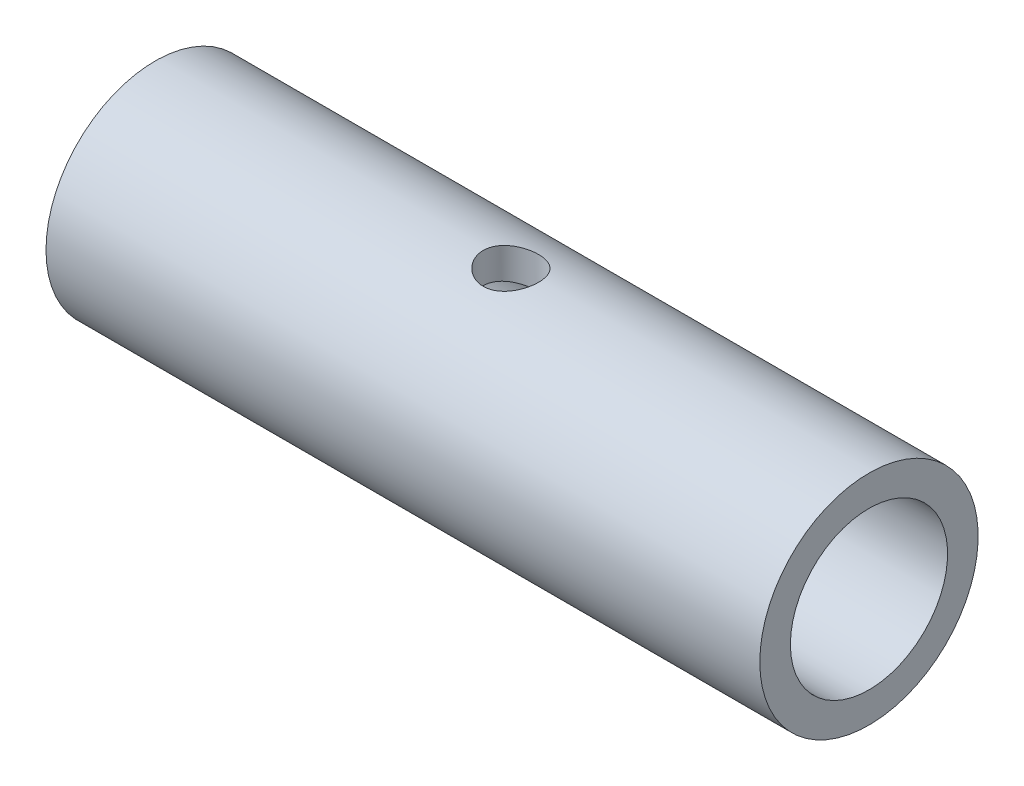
ISO-10303-21;
HEADER;
FILE_DESCRIPTION(('STEP AP214'),'2;1');
FILE_NAME('part.step','',(''),(''),'','','');
FILE_SCHEMA(('AUTOMOTIVE_DESIGN { 1 0 10303 214 1 1 1 1 }'));
ENDSEC;
DATA;
#1=APPLICATION_CONTEXT('core data for automotive mechanical design processes');
#2=APPLICATION_PROTOCOL_DEFINITION('international standard','automotive_design',2000,#1);
#3=PRODUCT_CONTEXT('',#1,'mechanical');
#4=PRODUCT('Part','Part','',(#3));
#5=PRODUCT_RELATED_PRODUCT_CATEGORY('part','',(#4));
#6=PRODUCT_DEFINITION_FORMATION('','',#4);
#7=PRODUCT_DEFINITION_CONTEXT('part definition',#1,'design');
#8=PRODUCT_DEFINITION('design','',#6,#7);
#9=PRODUCT_DEFINITION_SHAPE('','',#8);
#10=(LENGTH_UNIT() NAMED_UNIT(*) SI_UNIT(.MILLI.,.METRE.));
#11=(NAMED_UNIT(*) PLANE_ANGLE_UNIT() SI_UNIT($,.RADIAN.));
#12=(NAMED_UNIT(*) SI_UNIT($,.STERADIAN.) SOLID_ANGLE_UNIT());
#13=UNCERTAINTY_MEASURE_WITH_UNIT(LENGTH_MEASURE(1.E-05),#10,'distance_accuracy_value','');
#14=(GEOMETRIC_REPRESENTATION_CONTEXT(3) GLOBAL_UNCERTAINTY_ASSIGNED_CONTEXT((#13)) GLOBAL_UNIT_ASSIGNED_CONTEXT((#10,
#11,#12)) REPRESENTATION_CONTEXT('',''));
#15=CARTESIAN_POINT('',(0.,0.,0.));
#16=DIRECTION('',(0.,0.,1.));
#17=DIRECTION('',(1.,0.,0.));
#18=AXIS2_PLACEMENT_3D('',#15,#16,#17);
#19=CARTESIAN_POINT('',(31.1404,0.,0.));
#20=DIRECTION('',(-1.,0.,0.));
#21=DIRECTION('',(0.,0.,1.));
#22=AXIS2_PLACEMENT_3D('',#19,#20,#21);
#23=CYLINDRICAL_SURFACE('',#22,6.858);
#24=CARTESIAN_POINT('',(-0.1016,-6.41946999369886,-2.413));
#25=CARTESIAN_POINT('',(0.0291641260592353,-6.41947691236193,-2.41299228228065));
#26=CARTESIAN_POINT('',(0.160059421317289,-6.42351655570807,-2.40231841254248));
#27=CARTESIAN_POINT('',(0.418075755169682,-6.43917618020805,-2.36001205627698));
#28=CARTESIAN_POINT('',(0.545190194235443,-6.45080868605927,-2.32834493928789));
#29=CARTESIAN_POINT('',(0.791655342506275,-6.48016653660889,-2.24533365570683));
#30=CARTESIAN_POINT('',(0.911026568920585,-6.49787492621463,-2.19404420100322));
#31=CARTESIAN_POINT('',(1.13946976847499,-6.53736681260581,-2.07340571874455));
#32=CARTESIAN_POINT('',(1.24854228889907,-6.55915009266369,-2.00405765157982));
#33=CARTESIAN_POINT('',(1.4581175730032,-6.60541019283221,-1.84600956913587));
#34=CARTESIAN_POINT('',(1.55810647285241,-6.62995971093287,-1.75664918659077));
#35=CARTESIAN_POINT('',(1.74203801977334,-6.67837612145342,-1.56251537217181));
#36=CARTESIAN_POINT('',(1.82597697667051,-6.70224285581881,-1.45773840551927));
#37=CARTESIAN_POINT('',(1.9778043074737,-6.74745133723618,-1.23194410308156));
#38=CARTESIAN_POINT('',(2.04514768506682,-6.76869811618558,-1.11053959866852));
#39=CARTESIAN_POINT('',(2.15824831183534,-6.80541210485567,-0.857247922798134));
#40=CARTESIAN_POINT('',(2.20401215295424,-6.82088107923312,-0.725363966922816));
#41=CARTESIAN_POINT('',(2.27089234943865,-6.84378285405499,-0.460234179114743));
#42=CARTESIAN_POINT('',(2.29288812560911,-6.85150157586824,-0.327235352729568));
#43=CARTESIAN_POINT('',(2.31441331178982,-6.85905290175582,-0.0592254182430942));
#44=CARTESIAN_POINT('',(2.313949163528,-6.85888776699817,0.0757851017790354));
#45=CARTESIAN_POINT('',(2.29110592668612,-6.85087866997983,0.337727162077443));
#46=CARTESIAN_POINT('',(2.26968404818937,-6.84337011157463,0.464754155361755));
#47=CARTESIAN_POINT('',(2.2071279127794,-6.82194700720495,0.713279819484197));
#48=CARTESIAN_POINT('',(2.16599221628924,-6.80803199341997,0.834778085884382));
#49=CARTESIAN_POINT('',(2.06466676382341,-6.77495314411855,1.07078582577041));
#50=CARTESIAN_POINT('',(2.00422070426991,-6.75571920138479,1.18517502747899));
#51=CARTESIAN_POINT('',(1.8662106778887,-6.7139820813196,1.40245001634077));
#52=CARTESIAN_POINT('',(1.78864241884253,-6.69147808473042,1.50533290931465));
#53=CARTESIAN_POINT('',(1.61386831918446,-6.6441701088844,1.7023407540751));
#54=CARTESIAN_POINT('',(1.5158519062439,-6.61930737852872,1.79573350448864));
#55=CARTESIAN_POINT('',(1.30532377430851,-6.57103864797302,1.96504138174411));
#56=CARTESIAN_POINT('',(1.19280461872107,-6.54763340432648,2.0409474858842));
#57=CARTESIAN_POINT('',(0.953866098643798,-6.50457975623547,2.17430930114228));
#58=CARTESIAN_POINT('',(0.827231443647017,-6.48500728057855,2.2314049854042));
#59=CARTESIAN_POINT('',(0.565409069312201,-6.45273156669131,2.32310589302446));
#60=CARTESIAN_POINT('',(0.430240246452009,-6.44001370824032,2.35775901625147));
#61=CARTESIAN_POINT('',(0.22787660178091,-6.42758752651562,2.39131572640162));
#62=CARTESIAN_POINT('',(0.162293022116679,-6.42455475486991,2.3994361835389));
#63=CARTESIAN_POINT('',(0.0306174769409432,-6.42049423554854,2.41028028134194));
#64=CARTESIAN_POINT('',(-0.0354744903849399,-6.41946649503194,2.41300390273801));
#65=CARTESIAN_POINT('',(-0.232364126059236,-6.41947691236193,2.41299228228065));
#66=CARTESIAN_POINT('',(-0.363259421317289,-6.42351655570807,2.40231841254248));
#67=CARTESIAN_POINT('',(-0.621275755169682,-6.43917618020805,2.36001205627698));
#68=CARTESIAN_POINT('',(-0.748390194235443,-6.45080868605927,2.32834493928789));
#69=CARTESIAN_POINT('',(-0.994855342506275,-6.48016653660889,2.24533365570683));
#70=CARTESIAN_POINT('',(-1.11422656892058,-6.49787492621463,2.19404420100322));
#71=CARTESIAN_POINT('',(-1.34266976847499,-6.53736681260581,2.07340571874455));
#72=CARTESIAN_POINT('',(-1.45174228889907,-6.55915009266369,2.00405765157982));
#73=CARTESIAN_POINT('',(-1.6613175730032,-6.60541019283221,1.84600956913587));
#74=CARTESIAN_POINT('',(-1.76130647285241,-6.62995971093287,1.75664918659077));
#75=CARTESIAN_POINT('',(-1.94523801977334,-6.67837612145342,1.56251537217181));
#76=CARTESIAN_POINT('',(-2.02917697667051,-6.70224285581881,1.45773840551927));
#77=CARTESIAN_POINT('',(-2.1810043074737,-6.74745133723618,1.23194410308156));
#78=CARTESIAN_POINT('',(-2.24834768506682,-6.76869811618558,1.11053959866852));
#79=CARTESIAN_POINT('',(-2.36144831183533,-6.80541210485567,0.857247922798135));
#80=CARTESIAN_POINT('',(-2.40721215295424,-6.82088107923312,0.725363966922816));
#81=CARTESIAN_POINT('',(-2.47409234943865,-6.84378285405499,0.460234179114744));
#82=CARTESIAN_POINT('',(-2.49608812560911,-6.85150157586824,0.327235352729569));
#83=CARTESIAN_POINT('',(-2.51761331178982,-6.85905290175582,0.0592254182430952));
#84=CARTESIAN_POINT('',(-2.517149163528,-6.85888776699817,-0.0757851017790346));
#85=CARTESIAN_POINT('',(-2.49430592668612,-6.85087866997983,-0.337727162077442));
#86=CARTESIAN_POINT('',(-2.47288404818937,-6.84337011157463,-0.464754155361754));
#87=CARTESIAN_POINT('',(-2.4103279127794,-6.82194700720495,-0.713279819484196));
#88=CARTESIAN_POINT('',(-2.36919221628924,-6.80803199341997,-0.834778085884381));
#89=CARTESIAN_POINT('',(-2.26786676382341,-6.77495314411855,-1.07078582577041));
#90=CARTESIAN_POINT('',(-2.20742070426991,-6.75571920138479,-1.18517502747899));
#91=CARTESIAN_POINT('',(-2.0694106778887,-6.7139820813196,-1.40245001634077));
#92=CARTESIAN_POINT('',(-1.99184241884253,-6.69147808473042,-1.50533290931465));
#93=CARTESIAN_POINT('',(-1.81706831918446,-6.6441701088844,-1.7023407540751));
#94=CARTESIAN_POINT('',(-1.7190519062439,-6.61930737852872,-1.79573350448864));
#95=CARTESIAN_POINT('',(-1.50852377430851,-6.57103864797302,-1.96504138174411));
#96=CARTESIAN_POINT('',(-1.39600461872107,-6.54763340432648,-2.0409474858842));
#97=CARTESIAN_POINT('',(-1.1570660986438,-6.50457975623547,-2.17430930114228));
#98=CARTESIAN_POINT('',(-1.03043144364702,-6.48500728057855,-2.2314049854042));
#99=CARTESIAN_POINT('',(-0.768609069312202,-6.45273156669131,-2.32310589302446));
#100=CARTESIAN_POINT('',(-0.633440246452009,-6.44001370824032,-2.35775901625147));
#101=CARTESIAN_POINT('',(-0.43107660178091,-6.42758752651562,-2.39131572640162));
#102=CARTESIAN_POINT('',(-0.365493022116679,-6.42455475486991,-2.3994361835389));
#103=CARTESIAN_POINT('',(-0.233817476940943,-6.42049423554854,-2.41028028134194));
#104=CARTESIAN_POINT('',(-0.16772550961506,-6.41946649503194,-2.41300390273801));
#105=CARTESIAN_POINT('',(-0.1016,-6.41946999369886,-2.413));
#106=B_SPLINE_CURVE_WITH_KNOTS('',3,(#24,#25,#26,#27,#28,#29,#30,#31,#32,#33,#34,#35,#36,#37,
#38,#39,#40,#41,#42,#43,#44,#45,#46,#47,#48,#49,#50,#51,#52,#53,#54,#55,#56,#57,#58,#59,#60,#61,
#62,#63,#64,#65,#66,#67,#68,#69,#70,#71,#72,#73,#74,#75,#76,#77,#78,#79,#80,#81,#82,#83,#84,#85,
#86,#87,#88,#89,#90,#91,#92,#93,#94,#95,#96,#97,#98,#99,#100,#101,#102,#103,#104,#105),
.UNSPECIFIED.,.T.,.F.,(4,2,2,2,2,2,2,2,2,2,2,2,2,2,2,2,2,2,2,2,2,2,2,2,2,2,2,2,2,2,2,2,2,2,2,2,
2,2,2,2,4),(0.,0.392034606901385,0.78471752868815,1.17631344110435,1.56788853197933,
1.97504859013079,2.38230214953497,2.80153974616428,3.22064919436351,3.62365613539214,
4.02654749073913,4.41185743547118,4.79719552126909,5.18787689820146,5.57865632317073,
5.98972801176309,6.40101133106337,6.81976229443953,7.23761653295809,7.4358620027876,
7.63410818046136,8.02614278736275,8.41882570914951,8.81042162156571,9.20199671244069,
9.60915677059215,10.0164103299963,10.4356479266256,10.8547573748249,11.2577643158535,
11.6606556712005,12.0459656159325,12.4313037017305,12.8219850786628,13.2127645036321,
13.6238361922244,14.0351195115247,14.4538704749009,14.8717247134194,15.069970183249,
15.2682163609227),.UNSPECIFIED.);
#107=CARTESIAN_POINT('',(-0.1016,-6.41946999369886,-2.413));
#108=VERTEX_POINT('',#107);
#109=EDGE_CURVE('E55',#108,#108,#106,.T.);
#110=ORIENTED_EDGE('',*,*,#109,.T.);
#111=EDGE_LOOP('',(#110));
#112=FACE_BOUND('',#111,.T.);
#113=CARTESIAN_POINT('',(-31.1404,0.,0.));
#114=DIRECTION('',(-1.,0.,0.));
#115=DIRECTION('',(0.,0.,1.));
#116=AXIS2_PLACEMENT_3D('',#113,#114,#115);
#117=CIRCLE('',#116,6.858);
#118=CARTESIAN_POINT('',(-31.1404,0.,6.858));
#119=VERTEX_POINT('',#118);
#120=EDGE_CURVE('E60',#119,#119,#117,.T.);
#121=ORIENTED_EDGE('',*,*,#120,.T.);
#122=EDGE_LOOP('',(#121));
#123=FACE_BOUND('',#122,.T.);
#124=CARTESIAN_POINT('',(-0.1016,6.41946999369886,-2.413));
#125=CARTESIAN_POINT('',(-0.232364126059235,6.41947691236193,-2.41299228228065));
#126=CARTESIAN_POINT('',(-0.363259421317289,6.42351655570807,-2.40231841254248));
#127=CARTESIAN_POINT('',(-0.621275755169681,6.43917618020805,-2.36001205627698));
#128=CARTESIAN_POINT('',(-0.748390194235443,6.45080868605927,-2.32834493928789));
#129=CARTESIAN_POINT('',(-0.994855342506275,6.48016653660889,-2.24533365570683));
#130=CARTESIAN_POINT('',(-1.11422656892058,6.49787492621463,-2.19404420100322));
#131=CARTESIAN_POINT('',(-1.34266976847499,6.53736681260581,-2.07340571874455));
#132=CARTESIAN_POINT('',(-1.45174228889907,6.55915009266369,-2.00405765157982));
#133=CARTESIAN_POINT('',(-1.6613175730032,6.60541019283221,-1.84600956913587));
#134=CARTESIAN_POINT('',(-1.76130647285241,6.62995971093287,-1.75664918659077));
#135=CARTESIAN_POINT('',(-1.94523801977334,6.67837612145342,-1.56251537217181));
#136=CARTESIAN_POINT('',(-2.02917697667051,6.70224285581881,-1.45773840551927));
#137=CARTESIAN_POINT('',(-2.1810043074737,6.74745133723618,-1.23194410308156));
#138=CARTESIAN_POINT('',(-2.24834768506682,6.76869811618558,-1.11053959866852));
#139=CARTESIAN_POINT('',(-2.36144831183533,6.80541210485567,-0.857247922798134));
#140=CARTESIAN_POINT('',(-2.40721215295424,6.82088107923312,-0.725363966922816));
#141=CARTESIAN_POINT('',(-2.47409234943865,6.84378285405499,-0.460234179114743));
#142=CARTESIAN_POINT('',(-2.49608812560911,6.85150157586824,-0.327235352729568));
#143=CARTESIAN_POINT('',(-2.51761331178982,6.85905290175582,-0.0592254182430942));
#144=CARTESIAN_POINT('',(-2.517149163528,6.85888776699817,0.0757851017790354));
#145=CARTESIAN_POINT('',(-2.49430592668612,6.85087866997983,0.337727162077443));
#146=CARTESIAN_POINT('',(-2.47288404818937,6.84337011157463,0.464754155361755));
#147=CARTESIAN_POINT('',(-2.4103279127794,6.82194700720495,0.713279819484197));
#148=CARTESIAN_POINT('',(-2.36919221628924,6.80803199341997,0.834778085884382));
#149=CARTESIAN_POINT('',(-2.26786676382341,6.77495314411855,1.07078582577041));
#150=CARTESIAN_POINT('',(-2.20742070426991,6.75571920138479,1.18517502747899));
#151=CARTESIAN_POINT('',(-2.0694106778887,6.7139820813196,1.40245001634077));
#152=CARTESIAN_POINT('',(-1.99184241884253,6.69147808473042,1.50533290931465));
#153=CARTESIAN_POINT('',(-1.81706831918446,6.6441701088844,1.7023407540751));
#154=CARTESIAN_POINT('',(-1.7190519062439,6.61930737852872,1.79573350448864));
#155=CARTESIAN_POINT('',(-1.50852377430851,6.57103864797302,1.96504138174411));
#156=CARTESIAN_POINT('',(-1.39600461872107,6.54763340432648,2.0409474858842));
#157=CARTESIAN_POINT('',(-1.1570660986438,6.50457975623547,2.17430930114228));
#158=CARTESIAN_POINT('',(-1.03043144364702,6.48500728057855,2.2314049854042));
#159=CARTESIAN_POINT('',(-0.768609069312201,6.45273156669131,2.32310589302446));
#160=CARTESIAN_POINT('',(-0.633440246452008,6.44001370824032,2.35775901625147));
#161=CARTESIAN_POINT('',(-0.431076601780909,6.42758752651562,2.39131572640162));
#162=CARTESIAN_POINT('',(-0.365493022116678,6.42455475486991,2.3994361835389));
#163=CARTESIAN_POINT('',(-0.233817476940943,6.42049423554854,2.41028028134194));
#164=CARTESIAN_POINT('',(-0.16772550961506,6.41946649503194,2.41300390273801));
#165=CARTESIAN_POINT('',(0.0291641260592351,6.41947691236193,2.41299228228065));
#166=CARTESIAN_POINT('',(0.160059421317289,6.42351655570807,2.40231841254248));
#167=CARTESIAN_POINT('',(0.418075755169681,6.43917618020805,2.36001205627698));
#168=CARTESIAN_POINT('',(0.545190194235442,6.45080868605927,2.32834493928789));
#169=CARTESIAN_POINT('',(0.791655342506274,6.48016653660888,2.24533365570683));
#170=CARTESIAN_POINT('',(0.911026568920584,6.49787492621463,2.19404420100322));
#171=CARTESIAN_POINT('',(1.13946976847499,6.53736681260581,2.07340571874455));
#172=CARTESIAN_POINT('',(1.24854228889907,6.55915009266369,2.00405765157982));
#173=CARTESIAN_POINT('',(1.4581175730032,6.60541019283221,1.84600956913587));
#174=CARTESIAN_POINT('',(1.55810647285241,6.62995971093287,1.75664918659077));
#175=CARTESIAN_POINT('',(1.74203801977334,6.67837612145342,1.56251537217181));
#176=CARTESIAN_POINT('',(1.82597697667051,6.70224285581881,1.45773840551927));
#177=CARTESIAN_POINT('',(1.9778043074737,6.74745133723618,1.23194410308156));
#178=CARTESIAN_POINT('',(2.04514768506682,6.76869811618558,1.11053959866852));
#179=CARTESIAN_POINT('',(2.15824831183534,6.80541210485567,0.857247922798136));
#180=CARTESIAN_POINT('',(2.20401215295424,6.82088107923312,0.725363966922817));
#181=CARTESIAN_POINT('',(2.27089234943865,6.84378285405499,0.460234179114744));
#182=CARTESIAN_POINT('',(2.29288812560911,6.85150157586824,0.327235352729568));
#183=CARTESIAN_POINT('',(2.31441331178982,6.85905290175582,0.0592254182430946));
#184=CARTESIAN_POINT('',(2.313949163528,6.85888776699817,-0.0757851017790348));
#185=CARTESIAN_POINT('',(2.29110592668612,6.85087866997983,-0.337727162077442));
#186=CARTESIAN_POINT('',(2.26968404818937,6.84337011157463,-0.464754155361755));
#187=CARTESIAN_POINT('',(2.2071279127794,6.82194700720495,-0.713279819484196));
#188=CARTESIAN_POINT('',(2.16599221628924,6.80803199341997,-0.834778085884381));
#189=CARTESIAN_POINT('',(2.06466676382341,6.77495314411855,-1.07078582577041));
#190=CARTESIAN_POINT('',(2.00422070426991,6.75571920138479,-1.18517502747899));
#191=CARTESIAN_POINT('',(1.8662106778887,6.7139820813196,-1.40245001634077));
#192=CARTESIAN_POINT('',(1.78864241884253,6.69147808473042,-1.50533290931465));
#193=CARTESIAN_POINT('',(1.61386831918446,6.6441701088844,-1.7023407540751));
#194=CARTESIAN_POINT('',(1.5158519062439,6.61930737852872,-1.79573350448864));
#195=CARTESIAN_POINT('',(1.30532377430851,6.57103864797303,-1.96504138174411));
#196=CARTESIAN_POINT('',(1.19280461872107,6.54763340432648,-2.0409474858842));
#197=CARTESIAN_POINT('',(0.953866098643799,6.50457975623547,-2.17430930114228));
#198=CARTESIAN_POINT('',(0.827231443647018,6.48500728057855,-2.2314049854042));
#199=CARTESIAN_POINT('',(0.565409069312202,6.45273156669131,-2.32310589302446));
#200=CARTESIAN_POINT('',(0.43024024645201,6.44001370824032,-2.35775901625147));
#201=CARTESIAN_POINT('',(0.22787660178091,6.42758752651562,-2.39131572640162));
#202=CARTESIAN_POINT('',(0.162293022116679,6.42455475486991,-2.3994361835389));
#203=CARTESIAN_POINT('',(0.0306174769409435,6.42049423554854,-2.41028028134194));
#204=CARTESIAN_POINT('',(-0.0354744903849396,6.41946649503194,-2.41300390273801));
#205=CARTESIAN_POINT('',(-0.1016,6.41946999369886,-2.413));
#206=B_SPLINE_CURVE_WITH_KNOTS('',3,(#124,#125,#126,#127,#128,#129,#130,#131,#132,#133,#134,
#135,#136,#137,#138,#139,#140,#141,#142,#143,#144,#145,#146,#147,#148,#149,#150,#151,#152,#153,
#154,#155,#156,#157,#158,#159,#160,#161,#162,#163,#164,#165,#166,#167,#168,#169,#170,#171,#172,
#173,#174,#175,#176,#177,#178,#179,#180,#181,#182,#183,#184,#185,#186,#187,#188,#189,#190,#191,
#192,#193,#194,#195,#196,#197,#198,#199,#200,#201,#202,#203,#204,#205),.UNSPECIFIED.,.T.,.F.,(4,
2,2,2,2,2,2,2,2,2,2,2,2,2,2,2,2,2,2,2,2,2,2,2,2,2,2,2,2,2,2,2,2,2,2,2,2,2,2,2,4),(0.,
0.392034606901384,0.78471752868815,1.17631344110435,1.56788853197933,1.97504859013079,
2.38230214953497,2.80153974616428,3.22064919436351,3.62365613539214,4.02654749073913,
4.41185743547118,4.79719552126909,5.18787689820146,5.57865632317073,5.98972801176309,
6.40101133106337,6.81976229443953,7.23761653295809,7.4358620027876,7.63410818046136,
8.02614278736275,8.41882570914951,8.81042162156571,9.20199671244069,9.60915677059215,
10.0164103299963,10.4356479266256,10.8547573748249,11.2577643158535,11.6606556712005,
12.0459656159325,12.4313037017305,12.8219850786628,13.2127645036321,13.6238361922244,
14.0351195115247,14.4538704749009,14.8717247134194,15.069970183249,15.2682163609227),.UNSPECIFIED.);
#207=CARTESIAN_POINT('',(-0.1016,6.41946999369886,-2.413));
#208=VERTEX_POINT('',#207);
#209=EDGE_CURVE('E62',#208,#208,#206,.T.);
#210=ORIENTED_EDGE('',*,*,#209,.T.);
#211=EDGE_LOOP('',(#210));
#212=FACE_BOUND('',#211,.T.);
#213=CARTESIAN_POINT('',(31.1404,0.,0.));
#214=DIRECTION('',(-1.,0.,0.));
#215=DIRECTION('',(0.,0.,1.));
#216=AXIS2_PLACEMENT_3D('',#213,#214,#215);
#217=CIRCLE('',#216,6.858);
#218=CARTESIAN_POINT('',(31.1404,0.,6.858));
#219=VERTEX_POINT('',#218);
#220=EDGE_CURVE('E18',#219,#219,#217,.T.);
#221=ORIENTED_EDGE('',*,*,#220,.F.);
#222=EDGE_LOOP('',(#221));
#223=FACE_BOUND('',#222,.T.);
#224=ADVANCED_FACE('F14',(#112,#123,#212,#223),#23,.F.);
#225=CARTESIAN_POINT('',(31.1404,0.,0.));
#226=DIRECTION('',(1.,0.,0.));
#227=DIRECTION('',(0.,0.,-1.));
#228=AXIS2_PLACEMENT_3D('',#225,#226,#227);
#229=PLANE('',#228);
#230=ORIENTED_EDGE('',*,*,#220,.T.);
#231=EDGE_LOOP('',(#230));
#232=FACE_BOUND('',#231,.T.);
#233=CARTESIAN_POINT('',(31.1404,0.,0.));
#234=DIRECTION('',(-1.,0.,0.));
#235=DIRECTION('',(0.,0.,1.));
#236=AXIS2_PLACEMENT_3D('',#233,#234,#235);
#237=CIRCLE('',#236,9.525);
#238=CARTESIAN_POINT('',(31.1404,0.,9.525));
#239=VERTEX_POINT('',#238);
#240=EDGE_CURVE('E46',#239,#239,#237,.T.);
#241=ORIENTED_EDGE('',*,*,#240,.F.);
#242=EDGE_LOOP('',(#241));
#243=FACE_BOUND('',#242,.T.);
#244=ADVANCED_FACE('F52',(#232,#243),#229,.T.);
#245=CARTESIAN_POINT('',(-0.1016,-9.525,0.));
#246=DIRECTION('',(0.,1.,0.));
#247=DIRECTION('',(0.,0.,1.));
#248=AXIS2_PLACEMENT_3D('',#245,#246,#247);
#249=CYLINDRICAL_SURFACE('',#248,2.413);
#250=ORIENTED_EDGE('',*,*,#109,.F.);
#251=EDGE_LOOP('',(#250));
#252=FACE_BOUND('',#251,.T.);
#253=CARTESIAN_POINT('',(-0.1016,-9.21428543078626,2.413));
#254=CARTESIAN_POINT('',(0.0314290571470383,-9.21428993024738,2.41299310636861));
#255=CARTESIAN_POINT('',(0.164614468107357,-9.21720116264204,2.40194977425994));
#256=CARTESIAN_POINT('',(0.427275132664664,-9.22851354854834,2.35810366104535));
#257=CARTESIAN_POINT('',(0.556742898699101,-9.23692506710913,2.32525979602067));
#258=CARTESIAN_POINT('',(0.807953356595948,-9.25822355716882,2.23894631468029));
#259=CARTESIAN_POINT('',(0.929709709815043,-9.27110233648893,2.18551443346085));
#260=CARTESIAN_POINT('',(1.16250441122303,-9.29987367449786,2.05964163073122));
#261=CARTESIAN_POINT('',(1.27354535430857,-9.3157655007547,1.98720532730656));
#262=CARTESIAN_POINT('',(1.48432519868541,-9.34917912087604,1.82361406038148));
#263=CARTESIAN_POINT('',(1.58378575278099,-9.36672764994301,1.73210581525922));
#264=CARTESIAN_POINT('',(1.76612944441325,-9.40124644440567,1.53372461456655));
#265=CARTESIAN_POINT('',(1.84901009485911,-9.4182166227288,1.42684935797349));
#266=CARTESIAN_POINT('',(1.99696977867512,-9.44995976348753,1.19887376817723));
#267=CARTESIAN_POINT('',(2.06177670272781,-9.46469775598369,1.07759154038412));
#268=CARTESIAN_POINT('',(2.1699781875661,-9.49001271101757,0.825419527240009));
#269=CARTESIAN_POINT('',(2.21337615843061,-9.500590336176,0.694531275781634));
#270=CARTESIAN_POINT('',(2.2766403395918,-9.51620500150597,0.429747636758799));
#271=CARTESIAN_POINT('',(2.29697666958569,-9.52135257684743,0.295971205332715));
#272=CARTESIAN_POINT('',(2.31501662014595,-9.52591259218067,0.0268129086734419));
#273=CARTESIAN_POINT('',(2.3127236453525,-9.52532589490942,-0.108568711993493));
#274=CARTESIAN_POINT('',(2.2859068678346,-9.51856550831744,-0.373830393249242));
#275=CARTESIAN_POINT('',(2.26189076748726,-9.51251941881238,-0.503765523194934));
#276=CARTESIAN_POINT('',(2.19312606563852,-9.49566850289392,-0.757698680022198));
#277=CARTESIAN_POINT('',(2.14837621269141,-9.48486338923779,-0.881696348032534));
#278=CARTESIAN_POINT('',(2.03900629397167,-9.45951410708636,-1.12156668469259));
#279=CARTESIAN_POINT('',(1.97420630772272,-9.44493628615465,-1.23735361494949));
#280=CARTESIAN_POINT('',(1.82671680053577,-9.41362213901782,-1.45657922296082));
#281=CARTESIAN_POINT('',(1.74402527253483,-9.39688557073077,-1.56001651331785));
#282=CARTESIAN_POINT('',(1.56039884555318,-9.36252928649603,-1.7546270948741));
#283=CARTESIAN_POINT('',(1.4590233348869,-9.34489794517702,-1.84538299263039));
#284=CARTESIAN_POINT('',(1.24226066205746,-9.31115338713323,-2.00873801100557));
#285=CARTESIAN_POINT('',(1.12686728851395,-9.29504084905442,-2.08132903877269));
#286=CARTESIAN_POINT('',(0.884474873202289,-9.26611268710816,-2.20657018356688));
#287=CARTESIAN_POINT('',(0.757411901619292,-9.25331689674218,-2.25910119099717));
#288=CARTESIAN_POINT('',(0.496008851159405,-9.23273102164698,-2.34182613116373));
#289=CARTESIAN_POINT('',(0.361684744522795,-9.22493039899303,-2.37206710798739));
#290=CARTESIAN_POINT('',(0.171604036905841,-9.21817366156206,-2.39811153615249));
#291=CARTESIAN_POINT('',(0.117130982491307,-9.2167194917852,-2.40368922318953));
#292=CARTESIAN_POINT('',(0.00791412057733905,-9.21477444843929,-2.41113488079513));
#293=CARTESIAN_POINT('',(-0.0468296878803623,-9.21428357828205,-2.4130028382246));
#294=CARTESIAN_POINT('',(-0.234629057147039,-9.21428993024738,-2.41299310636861));
#295=CARTESIAN_POINT('',(-0.367814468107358,-9.21720116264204,-2.40194977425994));
#296=CARTESIAN_POINT('',(-0.630475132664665,-9.22851354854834,-2.35810366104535));
#297=CARTESIAN_POINT('',(-0.759942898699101,-9.23692506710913,-2.32525979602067));
#298=CARTESIAN_POINT('',(-1.01115335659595,-9.25822355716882,-2.23894631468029));
#299=CARTESIAN_POINT('',(-1.13290970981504,-9.27110233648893,-2.18551443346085));
#300=CARTESIAN_POINT('',(-1.36570441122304,-9.29987367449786,-2.05964163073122));
#301=CARTESIAN_POINT('',(-1.47674535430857,-9.3157655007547,-1.98720532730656));
#302=CARTESIAN_POINT('',(-1.68752519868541,-9.34917912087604,-1.82361406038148));
#303=CARTESIAN_POINT('',(-1.78698575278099,-9.36672764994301,-1.73210581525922));
#304=CARTESIAN_POINT('',(-1.96932944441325,-9.40124644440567,-1.53372461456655));
#305=CARTESIAN_POINT('',(-2.05221009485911,-9.4182166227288,-1.42684935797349));
#306=CARTESIAN_POINT('',(-2.20016977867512,-9.44995976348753,-1.19887376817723));
#307=CARTESIAN_POINT('',(-2.26497670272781,-9.46469775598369,-1.07759154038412));
#308=CARTESIAN_POINT('',(-2.3731781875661,-9.49001271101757,-0.825419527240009));
#309=CARTESIAN_POINT('',(-2.41657615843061,-9.500590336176,-0.694531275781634));
#310=CARTESIAN_POINT('',(-2.4798403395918,-9.51620500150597,-0.429747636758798));
#311=CARTESIAN_POINT('',(-2.50017666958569,-9.52135257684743,-0.295971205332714));
#312=CARTESIAN_POINT('',(-2.51821662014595,-9.52591259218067,-0.0268129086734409));
#313=CARTESIAN_POINT('',(-2.5159236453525,-9.52532589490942,0.108568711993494));
#314=CARTESIAN_POINT('',(-2.4891068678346,-9.51856550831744,0.373830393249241));
#315=CARTESIAN_POINT('',(-2.46509076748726,-9.51251941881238,0.503765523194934));
#316=CARTESIAN_POINT('',(-2.39632606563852,-9.49566850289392,0.757698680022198));
#317=CARTESIAN_POINT('',(-2.35157621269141,-9.48486338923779,0.881696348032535));
#318=CARTESIAN_POINT('',(-2.24220629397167,-9.45951410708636,1.12156668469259));
#319=CARTESIAN_POINT('',(-2.17740630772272,-9.44493628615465,1.23735361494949));
#320=CARTESIAN_POINT('',(-2.02991680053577,-9.41362213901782,1.45657922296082));
#321=CARTESIAN_POINT('',(-1.94722527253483,-9.39688557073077,1.56001651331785));
#322=CARTESIAN_POINT('',(-1.76359884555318,-9.36252928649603,1.7546270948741));
#323=CARTESIAN_POINT('',(-1.6622233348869,-9.34489794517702,1.84538299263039));
#324=CARTESIAN_POINT('',(-1.44546066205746,-9.31115338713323,2.00873801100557));
#325=CARTESIAN_POINT('',(-1.33006728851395,-9.29504084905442,2.08132903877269));
#326=CARTESIAN_POINT('',(-1.08767487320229,-9.26611268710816,2.20657018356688));
#327=CARTESIAN_POINT('',(-0.960611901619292,-9.25331689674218,2.25910119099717));
#328=CARTESIAN_POINT('',(-0.699208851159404,-9.23273102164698,2.34182613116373));
#329=CARTESIAN_POINT('',(-0.564884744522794,-9.22493039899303,2.37206710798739));
#330=CARTESIAN_POINT('',(-0.37480403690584,-9.21817366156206,2.39811153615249));
#331=CARTESIAN_POINT('',(-0.320330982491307,-9.2167194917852,2.40368922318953));
#332=CARTESIAN_POINT('',(-0.211114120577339,-9.21477444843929,2.41113488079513));
#333=CARTESIAN_POINT('',(-0.156370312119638,-9.21428357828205,2.4130028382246));
#334=CARTESIAN_POINT('',(-0.1016,-9.21428543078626,2.413));
#335=B_SPLINE_CURVE_WITH_KNOTS('',3,(#253,#254,#255,#256,#257,#258,#259,#260,#261,#262,#263,
#264,#265,#266,#267,#268,#269,#270,#271,#272,#273,#274,#275,#276,#277,#278,#279,#280,#281,#282,
#283,#284,#285,#286,#287,#288,#289,#290,#291,#292,#293,#294,#295,#296,#297,#298,#299,#300,#301,
#302,#303,#304,#305,#306,#307,#308,#309,#310,#311,#312,#313,#314,#315,#316,#317,#318,#319,#320,
#321,#322,#323,#324,#325,#326,#327,#328,#329,#330,#331,#332,#333,#334),.UNSPECIFIED.,.T.,.F.,(4,
2,2,2,2,2,2,2,2,2,2,2,2,2,2,2,2,2,2,2,2,2,2,2,2,2,2,2,2,2,2,2,2,2,2,2,2,2,2,2,4),(0.,
0.398876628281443,0.798507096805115,1.1974085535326,1.59621316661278,2.0031930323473,
2.41023390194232,2.82310751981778,3.23591535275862,3.64014752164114,4.04431887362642,
4.43928149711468,4.83426796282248,5.23290701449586,5.63159080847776,6.04128077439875,
6.45115294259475,6.86342229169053,7.27481901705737,7.43904268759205,7.6032669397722,
8.00214356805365,8.40177403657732,8.80067549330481,9.19948010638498,9.6064599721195,
10.0135008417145,10.42637445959,10.8391822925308,11.2434144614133,11.6475858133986,
12.0425484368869,12.4375349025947,12.8361739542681,13.23485774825,13.6445477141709,
14.0544198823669,14.4666892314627,14.8780859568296,15.0423096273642,15.2065338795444),.UNSPECIFIED.);
#336=CARTESIAN_POINT('',(-0.1016,-9.21428543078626,2.413));
#337=VERTEX_POINT('',#336);
#338=EDGE_CURVE('E27',#337,#337,#335,.T.);
#339=ORIENTED_EDGE('',*,*,#338,.F.);
#340=EDGE_LOOP('',(#339));
#341=FACE_BOUND('',#340,.T.);
#342=ADVANCED_FACE('F48',(#252,#341),#249,.F.);
#343=CARTESIAN_POINT('',(-31.1404,0.,0.));
#344=DIRECTION('',(1.,0.,0.));
#345=DIRECTION('',(0.,0.,-1.));
#346=AXIS2_PLACEMENT_3D('',#343,#344,#345);
#347=PLANE('',#346);
#348=ORIENTED_EDGE('',*,*,#120,.F.);
#349=EDGE_LOOP('',(#348));
#350=FACE_BOUND('',#349,.T.);
#351=CARTESIAN_POINT('',(-31.1404,0.,0.));
#352=DIRECTION('',(-1.,0.,0.));
#353=DIRECTION('',(0.,0.,1.));
#354=AXIS2_PLACEMENT_3D('',#351,#352,#353);
#355=CIRCLE('',#354,9.525);
#356=CARTESIAN_POINT('',(-31.1404,0.,9.525));
#357=VERTEX_POINT('',#356);
#358=EDGE_CURVE('E22',#357,#357,#355,.F.);
#359=ORIENTED_EDGE('',*,*,#358,.F.);
#360=EDGE_LOOP('',(#359));
#361=FACE_BOUND('',#360,.T.);
#362=ADVANCED_FACE('F51',(#350,#361),#347,.F.);
#363=CARTESIAN_POINT('',(-0.1016,-9.525,0.));
#364=DIRECTION('',(0.,1.,0.));
#365=DIRECTION('',(0.,0.,1.));
#366=AXIS2_PLACEMENT_3D('',#363,#364,#365);
#367=CYLINDRICAL_SURFACE('',#366,2.413);
#368=CARTESIAN_POINT('',(-0.1016,9.21428543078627,2.413));
#369=CARTESIAN_POINT('',(-0.234629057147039,9.21428993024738,2.41299310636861));
#370=CARTESIAN_POINT('',(-0.367814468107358,9.21720116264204,2.40194977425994));
#371=CARTESIAN_POINT('',(-0.630475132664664,9.22851354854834,2.35810366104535));
#372=CARTESIAN_POINT('',(-0.759942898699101,9.23692506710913,2.32525979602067));
#373=CARTESIAN_POINT('',(-1.01115335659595,9.25822355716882,2.23894631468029));
#374=CARTESIAN_POINT('',(-1.13290970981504,9.27110233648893,2.18551443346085));
#375=CARTESIAN_POINT('',(-1.36570441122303,9.29987367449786,2.05964163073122));
#376=CARTESIAN_POINT('',(-1.47674535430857,9.3157655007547,1.98720532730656));
#377=CARTESIAN_POINT('',(-1.68752519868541,9.34917912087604,1.82361406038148));
#378=CARTESIAN_POINT('',(-1.78698575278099,9.36672764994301,1.73210581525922));
#379=CARTESIAN_POINT('',(-1.96932944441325,9.40124644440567,1.53372461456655));
#380=CARTESIAN_POINT('',(-2.05221009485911,9.4182166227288,1.42684935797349));
#381=CARTESIAN_POINT('',(-2.20016977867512,9.44995976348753,1.19887376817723));
#382=CARTESIAN_POINT('',(-2.26497670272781,9.46469775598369,1.07759154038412));
#383=CARTESIAN_POINT('',(-2.3731781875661,9.49001271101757,0.825419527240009));
#384=CARTESIAN_POINT('',(-2.41657615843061,9.500590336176,0.694531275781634));
#385=CARTESIAN_POINT('',(-2.4798403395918,9.51620500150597,0.429747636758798));
#386=CARTESIAN_POINT('',(-2.50017666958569,9.52135257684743,0.295971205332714));
#387=CARTESIAN_POINT('',(-2.51821662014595,9.52591259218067,0.0268129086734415));
#388=CARTESIAN_POINT('',(-2.5159236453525,9.52532589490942,-0.108568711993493));
#389=CARTESIAN_POINT('',(-2.4891068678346,9.51856550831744,-0.373830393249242));
#390=CARTESIAN_POINT('',(-2.46509076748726,9.51251941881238,-0.503765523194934));
#391=CARTESIAN_POINT('',(-2.39632606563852,9.49566850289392,-0.757698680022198));
#392=CARTESIAN_POINT('',(-2.35157621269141,9.48486338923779,-0.881696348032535));
#393=CARTESIAN_POINT('',(-2.24220629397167,9.45951410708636,-1.1215666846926));
#394=CARTESIAN_POINT('',(-2.17740630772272,9.44493628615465,-1.23735361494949));
#395=CARTESIAN_POINT('',(-2.02991680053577,9.41362213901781,-1.45657922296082));
#396=CARTESIAN_POINT('',(-1.94722527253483,9.39688557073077,-1.56001651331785));
#397=CARTESIAN_POINT('',(-1.76359884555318,9.36252928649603,-1.7546270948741));
#398=CARTESIAN_POINT('',(-1.6622233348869,9.34489794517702,-1.84538299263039));
#399=CARTESIAN_POINT('',(-1.44546066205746,9.31115338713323,-2.00873801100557));
#400=CARTESIAN_POINT('',(-1.33006728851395,9.29504084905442,-2.08132903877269));
#401=CARTESIAN_POINT('',(-1.08767487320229,9.26611268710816,-2.20657018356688));
#402=CARTESIAN_POINT('',(-0.960611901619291,9.25331689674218,-2.25910119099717));
#403=CARTESIAN_POINT('',(-0.699208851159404,9.23273102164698,-2.34182613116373));
#404=CARTESIAN_POINT('',(-0.564884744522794,9.22493039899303,-2.37206710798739));
#405=CARTESIAN_POINT('',(-0.37480403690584,9.21817366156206,-2.39811153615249));
#406=CARTESIAN_POINT('',(-0.320330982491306,9.2167194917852,-2.40368922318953));
#407=CARTESIAN_POINT('',(-0.211114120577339,9.21477444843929,-2.41113488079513));
#408=CARTESIAN_POINT('',(-0.156370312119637,9.21428357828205,-2.4130028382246));
#409=CARTESIAN_POINT('',(0.031429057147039,9.21428993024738,-2.41299310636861));
#410=CARTESIAN_POINT('',(0.164614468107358,9.21720116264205,-2.40194977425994));
#411=CARTESIAN_POINT('',(0.427275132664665,9.22851354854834,-2.35810366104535));
#412=CARTESIAN_POINT('',(0.556742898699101,9.23692506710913,-2.32525979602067));
#413=CARTESIAN_POINT('',(0.807953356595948,9.25822355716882,-2.23894631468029));
#414=CARTESIAN_POINT('',(0.929709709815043,9.27110233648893,-2.18551443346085));
#415=CARTESIAN_POINT('',(1.16250441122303,9.29987367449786,-2.05964163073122));
#416=CARTESIAN_POINT('',(1.27354535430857,9.3157655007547,-1.98720532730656));
#417=CARTESIAN_POINT('',(1.48432519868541,9.34917912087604,-1.82361406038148));
#418=CARTESIAN_POINT('',(1.58378575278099,9.36672764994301,-1.73210581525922));
#419=CARTESIAN_POINT('',(1.76612944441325,9.40124644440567,-1.53372461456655));
#420=CARTESIAN_POINT('',(1.84901009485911,9.4182166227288,-1.42684935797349));
#421=CARTESIAN_POINT('',(1.99696977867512,9.44995976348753,-1.19887376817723));
#422=CARTESIAN_POINT('',(2.06177670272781,9.46469775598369,-1.07759154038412));
#423=CARTESIAN_POINT('',(2.1699781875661,9.49001271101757,-0.825419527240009));
#424=CARTESIAN_POINT('',(2.21337615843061,9.500590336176,-0.694531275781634));
#425=CARTESIAN_POINT('',(2.2766403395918,9.51620500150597,-0.429747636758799));
#426=CARTESIAN_POINT('',(2.29697666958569,9.52135257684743,-0.295971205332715));
#427=CARTESIAN_POINT('',(2.31501662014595,9.52591259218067,-0.026812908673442));
#428=CARTESIAN_POINT('',(2.3127236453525,9.52532589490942,0.108568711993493));
#429=CARTESIAN_POINT('',(2.2859068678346,9.51856550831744,0.373830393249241));
#430=CARTESIAN_POINT('',(2.26189076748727,9.51251941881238,0.503765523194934));
#431=CARTESIAN_POINT('',(2.19312606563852,9.49566850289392,0.757698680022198));
#432=CARTESIAN_POINT('',(2.14837621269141,9.48486338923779,0.881696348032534));
#433=CARTESIAN_POINT('',(2.03900629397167,9.45951410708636,1.12156668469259));
#434=CARTESIAN_POINT('',(1.97420630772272,9.44493628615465,1.23735361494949));
#435=CARTESIAN_POINT('',(1.82671680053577,9.41362213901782,1.45657922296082));
#436=CARTESIAN_POINT('',(1.74402527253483,9.39688557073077,1.56001651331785));
#437=CARTESIAN_POINT('',(1.56039884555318,9.36252928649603,1.7546270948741));
#438=CARTESIAN_POINT('',(1.4590233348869,9.34489794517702,1.84538299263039));
#439=CARTESIAN_POINT('',(1.24226066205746,9.31115338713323,2.00873801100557));
#440=CARTESIAN_POINT('',(1.12686728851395,9.29504084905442,2.08132903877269));
#441=CARTESIAN_POINT('',(0.884474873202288,9.26611268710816,2.20657018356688));
#442=CARTESIAN_POINT('',(0.757411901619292,9.25331689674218,2.25910119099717));
#443=CARTESIAN_POINT('',(0.496008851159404,9.23273102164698,2.34182613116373));
#444=CARTESIAN_POINT('',(0.361684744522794,9.22493039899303,2.37206710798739));
#445=CARTESIAN_POINT('',(0.171604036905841,9.21817366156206,2.39811153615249));
#446=CARTESIAN_POINT('',(0.117130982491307,9.2167194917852,2.40368922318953));
#447=CARTESIAN_POINT('',(0.00791412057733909,9.21477444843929,2.41113488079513));
#448=CARTESIAN_POINT('',(-0.0468296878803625,9.21428357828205,2.4130028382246));
#449=CARTESIAN_POINT('',(-0.1016,9.21428543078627,2.413));
#450=B_SPLINE_CURVE_WITH_KNOTS('',3,(#368,#369,#370,#371,#372,#373,#374,#375,#376,#377,#378,
#379,#380,#381,#382,#383,#384,#385,#386,#387,#388,#389,#390,#391,#392,#393,#394,#395,#396,#397,
#398,#399,#400,#401,#402,#403,#404,#405,#406,#407,#408,#409,#410,#411,#412,#413,#414,#415,#416,
#417,#418,#419,#420,#421,#422,#423,#424,#425,#426,#427,#428,#429,#430,#431,#432,#433,#434,#435,
#436,#437,#438,#439,#440,#441,#442,#443,#444,#445,#446,#447,#448,#449),.UNSPECIFIED.,.T.,.F.,(4,
2,2,2,2,2,2,2,2,2,2,2,2,2,2,2,2,2,2,2,2,2,2,2,2,2,2,2,2,2,2,2,2,2,2,2,2,2,2,2,4),(0.,
0.398876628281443,0.798507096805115,1.1974085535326,1.59621316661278,2.0031930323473,
2.41023390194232,2.82310751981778,3.23591535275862,3.64014752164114,4.04431887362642,
4.43928149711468,4.83426796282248,5.23290701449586,5.63159080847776,6.04128077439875,
6.45115294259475,6.86342229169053,7.27481901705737,7.43904268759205,7.6032669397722,
8.00214356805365,8.40177403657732,8.8006754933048,9.19948010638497,9.6064599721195,
10.0135008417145,10.42637445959,10.8391822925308,11.2434144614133,11.6475858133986,
12.0425484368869,12.4375349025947,12.8361739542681,13.23485774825,13.6445477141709,
14.0544198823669,14.4666892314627,14.8780859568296,15.0423096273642,15.2065338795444),.UNSPECIFIED.);
#451=CARTESIAN_POINT('',(-0.1016,9.21428543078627,2.413));
#452=VERTEX_POINT('',#451);
#453=EDGE_CURVE('E10',#452,#452,#450,.T.);
#454=ORIENTED_EDGE('',*,*,#453,.F.);
#455=EDGE_LOOP('',(#454));
#456=FACE_BOUND('',#455,.T.);
#457=ORIENTED_EDGE('',*,*,#209,.F.);
#458=EDGE_LOOP('',(#457));
#459=FACE_BOUND('',#458,.T.);
#460=ADVANCED_FACE('F34',(#456,#459),#367,.F.);
#461=CARTESIAN_POINT('',(31.1404,0.,0.));
#462=DIRECTION('',(-1.,0.,0.));
#463=DIRECTION('',(0.,0.,1.));
#464=AXIS2_PLACEMENT_3D('',#461,#462,#463);
#465=CYLINDRICAL_SURFACE('',#464,9.525);
#466=ORIENTED_EDGE('',*,*,#453,.T.);
#467=EDGE_LOOP('',(#466));
#468=FACE_BOUND('',#467,.T.);
#469=ORIENTED_EDGE('',*,*,#358,.T.);
#470=EDGE_LOOP('',(#469));
#471=FACE_BOUND('',#470,.T.);
#472=ORIENTED_EDGE('',*,*,#338,.T.);
#473=EDGE_LOOP('',(#472));
#474=FACE_BOUND('',#473,.T.);
#475=ORIENTED_EDGE('',*,*,#240,.T.);
#476=EDGE_LOOP('',(#475));
#477=FACE_BOUND('',#476,.T.);
#478=ADVANCED_FACE('F37',(#468,#471,#474,#477),#465,.T.);
#479=CLOSED_SHELL('',(#224,#244,#342,#362,#460,#478));
#480=MANIFOLD_SOLID_BREP('B1',#479);
#481=ADVANCED_BREP_SHAPE_REPRESENTATION('',(#18,#480),#14);
#482=SHAPE_DEFINITION_REPRESENTATION(#9,#481);
ENDSEC;
END-ISO-10303-21;
